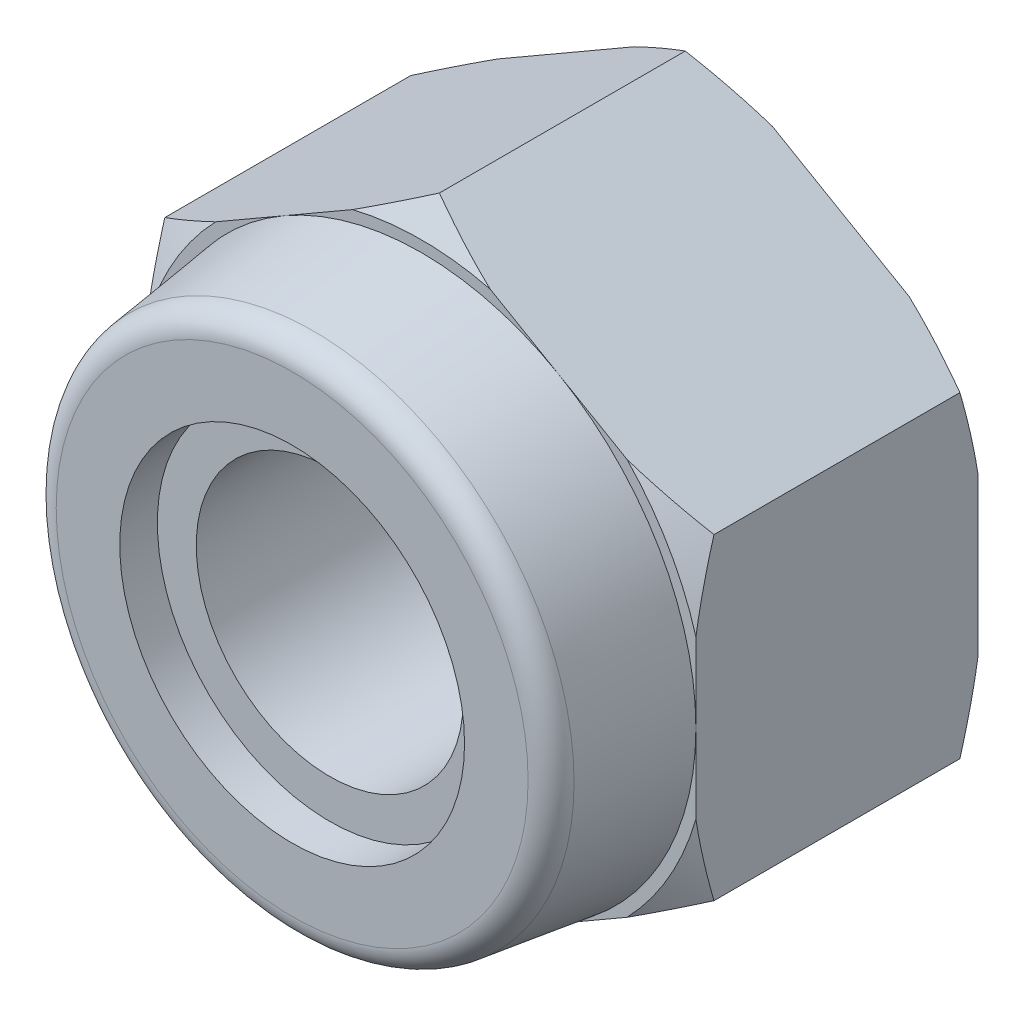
from build123d import *

# Parameters (mm, degrees)
BASENUTSKE_R  = 2.7051
BASENUT_DEPTH = 5.715


with BuildPart() as part:
    # BaseNutSke → BaseNut (new body)
    with BuildSketch(Plane.XY):
        Polygon((5.5626, -3.211568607), (5.5626, 3.211568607), (0, 6.423137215), (-5.5626, 3.211568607), (-5.5626, -3.211568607), (0, -6.423137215), align=None)
        Circle(BASENUTSKE_R, mode=Mode.SUBTRACT)
    extrude(amount=-BASENUT_DEPTH)

    # TorqEleSke → TorqueElement (revolve)
    with BuildSketch(Plane(origin=(0, 0, 0), x_dir=(0, 0, -1), z_dir=(0, 1, 0)), mode=Mode.PRIVATE) as torqueelement_sk:
        with BuildLine():
            Line((-1.8542, 3.4925), (-1.8542, 2.7051))
            Line((-1.8542, 2.7051), (0, 2.7051))
            Line((0, 2.7051), (0, 5.5626))
            Line((0, 5.5626), (-2.181463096, 5.275404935))
            ThreePointArc((-2.181463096, 5.275404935), (-2.492119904, 5.109355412), (-2.6162, 4.779682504))
            Line((-2.6162, 4.779682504), (-2.6162, 3.4925))
            Line((-2.6162, 3.4925), (-1.8542, 3.4925))
        make_face()
    revolve(torqueelement_sk.sketch.rotate(Axis((0, 0, 9.480888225), (0, 0, -1)), 180), axis=Axis((0, 0, 9.480888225), (0, 0, -1)))

    # Sketch3 → DoubleChamfer (revolve, cut)
    with BuildSketch(Plane(origin=(0, 0, 0), x_dir=(0, 0, -1), z_dir=(1, 0, 0))):
        Polygon((5.715, 5.788137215), (5.348382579, 6.423137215), (5.715, 6.423137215), align=None)
        Polygon((0, 6.423137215), (0, 5.788137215), (0.366617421, 6.423137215), align=None)
    revolve(axis=Axis((0, 0, 0), (0, 0, -1)), mode=Mode.SUBTRACT)

    # ThdSchSke → ThreadSchematic (revolve, cut)
    with BuildSketch(Plane(origin=(0, 0, 0), x_dir=(1, 0, 0), z_dir=(0, 1, 0)), mode=Mode.PRIVATE) as threadschematic_sk:
        Polygon((-3.175, 5.715), (-2.7051, 5.986296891), (-2.7051, 5.443703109), align=None)
    revolve(threadschematic_sk.sketch.rotate(Axis((0, 0, 1.481463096), (0, 0, 1)), 180), axis=Axis((0, 0, 1.481463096), (0, 0, 1)), mode=Mode.SUBTRACT)


solid = part.part
